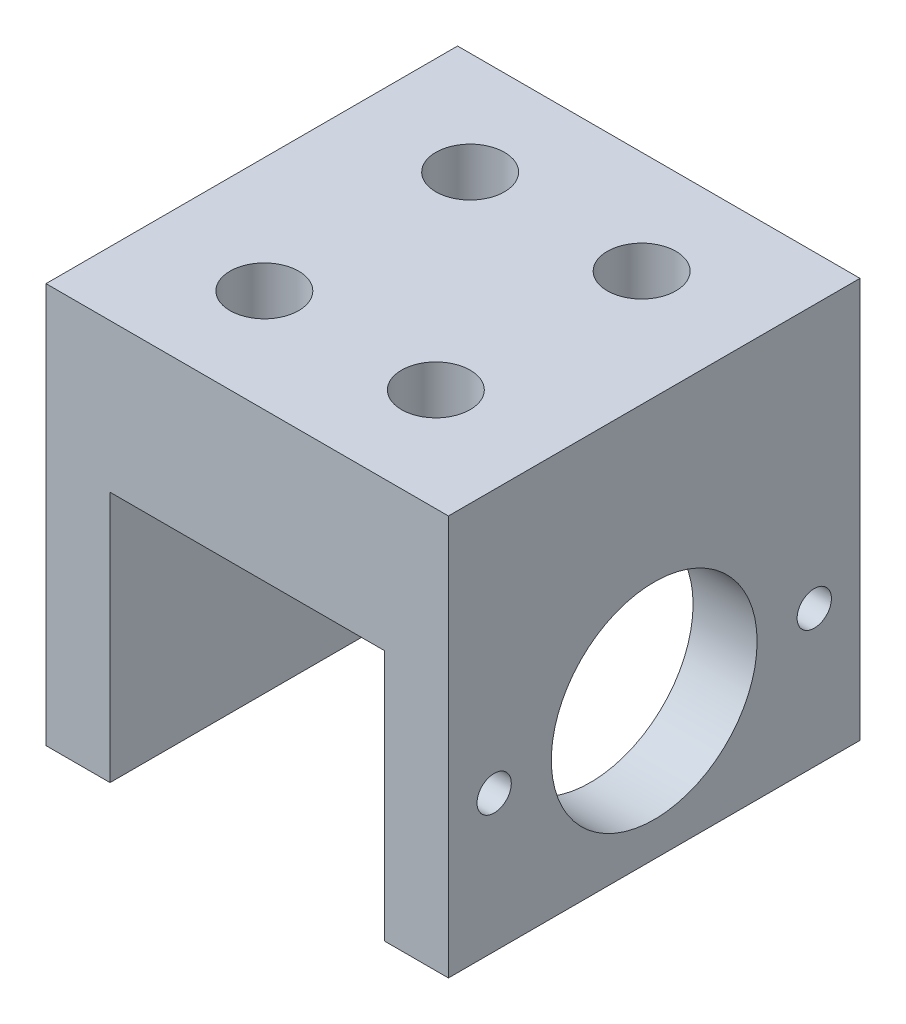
ISO-10303-21;
HEADER;
FILE_DESCRIPTION(('STEP AP214'),'2;1');
FILE_NAME('part.step','',(''),(''),'','','');
FILE_SCHEMA(('AUTOMOTIVE_DESIGN { 1 0 10303 214 1 1 1 1 }'));
ENDSEC;
DATA;
#1=APPLICATION_CONTEXT('core data for automotive mechanical design processes');
#2=APPLICATION_PROTOCOL_DEFINITION('international standard','automotive_design',2000,#1);
#3=PRODUCT_CONTEXT('',#1,'mechanical');
#4=PRODUCT('Part','Part','',(#3));
#5=PRODUCT_RELATED_PRODUCT_CATEGORY('part','',(#4));
#6=PRODUCT_DEFINITION_FORMATION('','',#4);
#7=PRODUCT_DEFINITION_CONTEXT('part definition',#1,'design');
#8=PRODUCT_DEFINITION('design','',#6,#7);
#9=PRODUCT_DEFINITION_SHAPE('','',#8);
#10=(LENGTH_UNIT() NAMED_UNIT(*) SI_UNIT(.MILLI.,.METRE.));
#11=(NAMED_UNIT(*) PLANE_ANGLE_UNIT() SI_UNIT($,.RADIAN.));
#12=(NAMED_UNIT(*) SI_UNIT($,.STERADIAN.) SOLID_ANGLE_UNIT());
#13=UNCERTAINTY_MEASURE_WITH_UNIT(LENGTH_MEASURE(1.E-05),#10,'distance_accuracy_value','');
#14=(GEOMETRIC_REPRESENTATION_CONTEXT(3) GLOBAL_UNCERTAINTY_ASSIGNED_CONTEXT((#13)) GLOBAL_UNIT_ASSIGNED_CONTEXT((#10,
#11,#12)) REPRESENTATION_CONTEXT('',''));
#15=CARTESIAN_POINT('',(0.,0.,0.));
#16=DIRECTION('',(0.,0.,1.));
#17=DIRECTION('',(1.,0.,0.));
#18=AXIS2_PLACEMENT_3D('',#15,#16,#17);
#19=CARTESIAN_POINT('',(0.,-35.,0.));
#20=DIRECTION('',(0.,1.,0.));
#21=DIRECTION('',(0.,0.,1.));
#22=AXIS2_PLACEMENT_3D('',#19,#20,#21);
#23=PLANE('',#22);
#24=DIRECTION('',(1.,0.,0.));
#25=VECTOR('',#24,1.);
#26=CARTESIAN_POINT('',(-17.6,-35.,18.));
#27=LINE('',#26,#25);
#28=CARTESIAN_POINT('',(12.,-35.,18.));
#29=VERTEX_POINT('',#28);
#30=CARTESIAN_POINT('',(17.6,-35.,18.));
#31=VERTEX_POINT('',#30);
#32=EDGE_CURVE('E41',#29,#31,#27,.T.);
#33=ORIENTED_EDGE('',*,*,#32,.F.);
#34=DIRECTION('',(0.,0.,-1.));
#35=VECTOR('',#34,1.);
#36=CARTESIAN_POINT('',(12.,-35.,18.));
#37=LINE('',#36,#35);
#38=CARTESIAN_POINT('',(12.,-35.,-18.));
#39=VERTEX_POINT('',#38);
#40=EDGE_CURVE('E90',#29,#39,#37,.T.);
#41=ORIENTED_EDGE('',*,*,#40,.T.);
#42=DIRECTION('',(-1.,0.,0.));
#43=VECTOR('',#42,1.);
#44=CARTESIAN_POINT('',(17.6,-35.,-18.));
#45=LINE('',#44,#43);
#46=CARTESIAN_POINT('',(17.6,-35.,-18.));
#47=VERTEX_POINT('',#46);
#48=EDGE_CURVE('E112',#47,#39,#45,.T.);
#49=ORIENTED_EDGE('',*,*,#48,.F.);
#50=DIRECTION('',(0.,0.,-1.));
#51=VECTOR('',#50,1.);
#52=CARTESIAN_POINT('',(17.6,-35.,18.));
#53=LINE('',#52,#51);
#54=EDGE_CURVE('E106',#31,#47,#53,.T.);
#55=ORIENTED_EDGE('',*,*,#54,.F.);
#56=EDGE_LOOP('',(#33,#41,#49,#55));
#57=FACE_BOUND('',#56,.T.);
#58=ADVANCED_FACE('F16',(#57),#23,.F.);
#59=CARTESIAN_POINT('',(17.6,-35.,18.));
#60=DIRECTION('',(1.,0.,0.));
#61=DIRECTION('',(0.,0.,-1.));
#62=AXIS2_PLACEMENT_3D('',#59,#60,#61);
#63=PLANE('',#62);
#64=CARTESIAN_POINT('',(17.6,-23.,0.));
#65=DIRECTION('',(1.,0.,0.));
#66=DIRECTION('',(0.,0.,-1.));
#67=AXIS2_PLACEMENT_3D('',#64,#65,#66);
#68=CIRCLE('',#67,9.);
#69=CARTESIAN_POINT('',(17.6,-23.,-9.));
#70=VERTEX_POINT('',#69);
#71=EDGE_CURVE('E211',#70,#70,#68,.T.);
#72=ORIENTED_EDGE('',*,*,#71,.F.);
#73=EDGE_LOOP('',(#72));
#74=FACE_BOUND('',#73,.T.);
#75=CARTESIAN_POINT('',(17.6,-23.,14.));
#76=DIRECTION('',(1.,0.,0.));
#77=DIRECTION('',(0.,0.,-1.));
#78=AXIS2_PLACEMENT_3D('',#75,#76,#77);
#79=CIRCLE('',#78,1.49999999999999);
#80=CARTESIAN_POINT('',(17.6,-23.,12.5));
#81=VERTEX_POINT('',#80);
#82=EDGE_CURVE('E136',#81,#81,#79,.T.);
#83=ORIENTED_EDGE('',*,*,#82,.F.);
#84=EDGE_LOOP('',(#83));
#85=FACE_BOUND('',#84,.T.);
#86=CARTESIAN_POINT('',(17.6,-23.,-14.));
#87=DIRECTION('',(1.,0.,0.));
#88=DIRECTION('',(0.,0.,-1.));
#89=AXIS2_PLACEMENT_3D('',#86,#87,#88);
#90=CIRCLE('',#89,1.49999999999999);
#91=CARTESIAN_POINT('',(17.6,-23.,-15.5));
#92=VERTEX_POINT('',#91);
#93=EDGE_CURVE('E164',#92,#92,#90,.T.);
#94=ORIENTED_EDGE('',*,*,#93,.F.);
#95=EDGE_LOOP('',(#94));
#96=FACE_BOUND('',#95,.T.);
#97=DIRECTION('',(0.,0.,-1.));
#98=VECTOR('',#97,1.);
#99=CARTESIAN_POINT('',(17.6,0.,18.));
#100=LINE('',#99,#98);
#101=CARTESIAN_POINT('',(17.6,0.,18.));
#102=VERTEX_POINT('',#101);
#103=CARTESIAN_POINT('',(17.6,0.,-18.));
#104=VERTEX_POINT('',#103);
#105=EDGE_CURVE('E116',#102,#104,#100,.T.);
#106=ORIENTED_EDGE('',*,*,#105,.F.);
#107=DIRECTION('',(0.,1.,0.));
#108=VECTOR('',#107,1.);
#109=CARTESIAN_POINT('',(17.6,-35.,18.));
#110=LINE('',#109,#108);
#111=EDGE_CURVE('E10',#31,#102,#110,.T.);
#112=ORIENTED_EDGE('',*,*,#111,.F.);
#113=ORIENTED_EDGE('',*,*,#54,.T.);
#114=DIRECTION('',(0.,1.,0.));
#115=VECTOR('',#114,1.);
#116=CARTESIAN_POINT('',(17.6,-35.,-18.));
#117=LINE('',#116,#115);
#118=EDGE_CURVE('E66',#47,#104,#117,.T.);
#119=ORIENTED_EDGE('',*,*,#118,.T.);
#120=EDGE_LOOP('',(#106,#112,#113,#119));
#121=FACE_BOUND('',#120,.T.);
#122=ADVANCED_FACE('F18',(#74,#85,#96,#121),#63,.T.);
#123=CARTESIAN_POINT('',(-17.6,-35.,18.));
#124=DIRECTION('',(0.,0.,1.));
#125=DIRECTION('',(1.,0.,0.));
#126=AXIS2_PLACEMENT_3D('',#123,#124,#125);
#127=PLANE('',#126);
#128=DIRECTION('',(0.,-1.,0.));
#129=VECTOR('',#128,1.);
#130=CARTESIAN_POINT('',(12.,-13.,18.));
#131=LINE('',#130,#129);
#132=CARTESIAN_POINT('',(12.,-13.,18.));
#133=VERTEX_POINT('',#132);
#134=EDGE_CURVE('E92',#133,#29,#131,.T.);
#135=ORIENTED_EDGE('',*,*,#134,.T.);
#136=ORIENTED_EDGE('',*,*,#32,.T.);
#137=ORIENTED_EDGE('',*,*,#111,.T.);
#138=DIRECTION('',(1.,0.,0.));
#139=VECTOR('',#138,1.);
#140=CARTESIAN_POINT('',(-17.6,0.,18.));
#141=LINE('',#140,#139);
#142=CARTESIAN_POINT('',(-17.6,0.,18.));
#143=VERTEX_POINT('',#142);
#144=EDGE_CURVE('E126',#143,#102,#141,.T.);
#145=ORIENTED_EDGE('',*,*,#144,.F.);
#146=DIRECTION('',(0.,1.,0.));
#147=VECTOR('',#146,1.);
#148=CARTESIAN_POINT('',(-17.6,-35.,18.));
#149=LINE('',#148,#147);
#150=CARTESIAN_POINT('',(-17.6,-35.,18.));
#151=VERTEX_POINT('',#150);
#152=EDGE_CURVE('E25',#151,#143,#149,.T.);
#153=ORIENTED_EDGE('',*,*,#152,.F.);
#154=CARTESIAN_POINT('',(-12.,-35.,18.));
#155=VERTEX_POINT('',#154);
#156=EDGE_CURVE('E107',#151,#155,#27,.T.);
#157=ORIENTED_EDGE('',*,*,#156,.T.);
#158=DIRECTION('',(0.,1.,0.));
#159=VECTOR('',#158,1.);
#160=CARTESIAN_POINT('',(-12.,-35.,18.));
#161=LINE('',#160,#159);
#162=CARTESIAN_POINT('',(-12.,-13.,18.));
#163=VERTEX_POINT('',#162);
#164=EDGE_CURVE('E33',#155,#163,#161,.T.);
#165=ORIENTED_EDGE('',*,*,#164,.T.);
#166=DIRECTION('',(1.,0.,0.));
#167=VECTOR('',#166,1.);
#168=CARTESIAN_POINT('',(-12.,-13.,18.));
#169=LINE('',#168,#167);
#170=EDGE_CURVE('E98',#163,#133,#169,.T.);
#171=ORIENTED_EDGE('',*,*,#170,.T.);
#172=EDGE_LOOP('',(#135,#136,#137,#145,#153,#157,#165,#171));
#173=FACE_BOUND('',#172,.T.);
#174=ADVANCED_FACE('F100',(#173),#127,.T.);
#175=CARTESIAN_POINT('',(-17.6,-35.,-18.));
#176=DIRECTION('',(-1.,0.,0.));
#177=DIRECTION('',(0.,0.,1.));
#178=AXIS2_PLACEMENT_3D('',#175,#176,#177);
#179=PLANE('',#178);
#180=DIRECTION('',(0.,0.,1.));
#181=VECTOR('',#180,1.);
#182=CARTESIAN_POINT('',(-17.6,0.,-18.));
#183=LINE('',#182,#181);
#184=CARTESIAN_POINT('',(-17.6,0.,-18.));
#185=VERTEX_POINT('',#184);
#186=EDGE_CURVE('E123',#185,#143,#183,.T.);
#187=ORIENTED_EDGE('',*,*,#186,.F.);
#188=DIRECTION('',(0.,1.,0.));
#189=VECTOR('',#188,1.);
#190=CARTESIAN_POINT('',(-17.6,-35.,-18.));
#191=LINE('',#190,#189);
#192=CARTESIAN_POINT('',(-17.6,-35.,-18.));
#193=VERTEX_POINT('',#192);
#194=EDGE_CURVE('E130',#193,#185,#191,.T.);
#195=ORIENTED_EDGE('',*,*,#194,.F.);
#196=DIRECTION('',(0.,0.,1.));
#197=VECTOR('',#196,1.);
#198=CARTESIAN_POINT('',(-17.6,-35.,-18.));
#199=LINE('',#198,#197);
#200=EDGE_CURVE('E108',#193,#151,#199,.T.);
#201=ORIENTED_EDGE('',*,*,#200,.T.);
#202=ORIENTED_EDGE('',*,*,#152,.T.);
#203=EDGE_LOOP('',(#187,#195,#201,#202));
#204=FACE_BOUND('',#203,.T.);
#205=ADVANCED_FACE('F192',(#204),#179,.T.);
#206=CARTESIAN_POINT('',(17.6,-35.,-18.));
#207=DIRECTION('',(0.,0.,-1.));
#208=DIRECTION('',(-1.,0.,0.));
#209=AXIS2_PLACEMENT_3D('',#206,#207,#208);
#210=PLANE('',#209);
#211=DIRECTION('',(0.,-1.,0.));
#212=VECTOR('',#211,1.);
#213=CARTESIAN_POINT('',(12.,-13.,-18.));
#214=LINE('',#213,#212);
#215=CARTESIAN_POINT('',(12.,-13.,-18.));
#216=VERTEX_POINT('',#215);
#217=EDGE_CURVE('E95',#216,#39,#214,.T.);
#218=ORIENTED_EDGE('',*,*,#217,.F.);
#219=DIRECTION('',(1.,0.,0.));
#220=VECTOR('',#219,1.);
#221=CARTESIAN_POINT('',(-12.,-13.,-18.));
#222=LINE('',#221,#220);
#223=CARTESIAN_POINT('',(-12.,-13.,-18.));
#224=VERTEX_POINT('',#223);
#225=EDGE_CURVE('E102',#224,#216,#222,.T.);
#226=ORIENTED_EDGE('',*,*,#225,.F.);
#227=DIRECTION('',(0.,1.,0.));
#228=VECTOR('',#227,1.);
#229=CARTESIAN_POINT('',(-12.,-35.,-18.));
#230=LINE('',#229,#228);
#231=CARTESIAN_POINT('',(-12.,-35.,-18.));
#232=VERTEX_POINT('',#231);
#233=EDGE_CURVE('E173',#232,#224,#230,.T.);
#234=ORIENTED_EDGE('',*,*,#233,.F.);
#235=EDGE_CURVE('E182',#232,#193,#45,.T.);
#236=ORIENTED_EDGE('',*,*,#235,.T.);
#237=ORIENTED_EDGE('',*,*,#194,.T.);
#238=DIRECTION('',(-1.,0.,0.));
#239=VECTOR('',#238,1.);
#240=CARTESIAN_POINT('',(17.6,0.,-18.));
#241=LINE('',#240,#239);
#242=EDGE_CURVE('E119',#104,#185,#241,.T.);
#243=ORIENTED_EDGE('',*,*,#242,.F.);
#244=ORIENTED_EDGE('',*,*,#118,.F.);
#245=ORIENTED_EDGE('',*,*,#48,.T.);
#246=EDGE_LOOP('',(#218,#226,#234,#236,#237,#243,#244,#245));
#247=FACE_BOUND('',#246,.T.);
#248=ADVANCED_FACE('F186',(#247),#210,.T.);
#249=ORIENTED_EDGE('',*,*,#235,.F.);
#250=DIRECTION('',(0.,0.,-1.));
#251=VECTOR('',#250,1.);
#252=CARTESIAN_POINT('',(-12.,-35.,18.));
#253=LINE('',#252,#251);
#254=EDGE_CURVE('E97',#155,#232,#253,.T.);
#255=ORIENTED_EDGE('',*,*,#254,.F.);
#256=ORIENTED_EDGE('',*,*,#156,.F.);
#257=ORIENTED_EDGE('',*,*,#200,.F.);
#258=EDGE_LOOP('',(#249,#255,#256,#257));
#259=FACE_BOUND('',#258,.T.);
#260=ADVANCED_FACE('F194',(#259),#23,.F.);
#261=CARTESIAN_POINT('',(0.,0.,0.));
#262=DIRECTION('',(0.,1.,0.));
#263=DIRECTION('',(0.,0.,1.));
#264=AXIS2_PLACEMENT_3D('',#261,#262,#263);
#265=PLANE('',#264);
#266=CARTESIAN_POINT('',(7.5,0.,9.));
#267=DIRECTION('',(0.,1.,0.));
#268=DIRECTION('',(0.,0.,1.));
#269=AXIS2_PLACEMENT_3D('',#266,#267,#268);
#270=CIRCLE('',#269,3.);
#271=CARTESIAN_POINT('',(7.5,0.,12.));
#272=VERTEX_POINT('',#271);
#273=EDGE_CURVE('E153',#272,#272,#270,.T.);
#274=ORIENTED_EDGE('',*,*,#273,.F.);
#275=EDGE_LOOP('',(#274));
#276=FACE_BOUND('',#275,.T.);
#277=CARTESIAN_POINT('',(-7.5,0.,9.));
#278=DIRECTION('',(0.,1.,0.));
#279=DIRECTION('',(0.,0.,1.));
#280=AXIS2_PLACEMENT_3D('',#277,#278,#279);
#281=CIRCLE('',#280,3.);
#282=CARTESIAN_POINT('',(-7.5,0.,12.));
#283=VERTEX_POINT('',#282);
#284=EDGE_CURVE('E143',#283,#283,#281,.T.);
#285=ORIENTED_EDGE('',*,*,#284,.F.);
#286=EDGE_LOOP('',(#285));
#287=FACE_BOUND('',#286,.T.);
#288=CARTESIAN_POINT('',(-7.5,0.,-9.));
#289=DIRECTION('',(0.,1.,0.));
#290=DIRECTION('',(0.,0.,1.));
#291=AXIS2_PLACEMENT_3D('',#288,#289,#290);
#292=CIRCLE('',#291,3.);
#293=CARTESIAN_POINT('',(-7.5,0.,-6.));
#294=VERTEX_POINT('',#293);
#295=EDGE_CURVE('E140',#294,#294,#292,.T.);
#296=ORIENTED_EDGE('',*,*,#295,.F.);
#297=EDGE_LOOP('',(#296));
#298=FACE_BOUND('',#297,.T.);
#299=CARTESIAN_POINT('',(7.5,0.,-9.));
#300=DIRECTION('',(0.,1.,0.));
#301=DIRECTION('',(0.,0.,1.));
#302=AXIS2_PLACEMENT_3D('',#299,#300,#301);
#303=CIRCLE('',#302,3.);
#304=CARTESIAN_POINT('',(7.5,0.,-6.));
#305=VERTEX_POINT('',#304);
#306=EDGE_CURVE('E137',#305,#305,#303,.T.);
#307=ORIENTED_EDGE('',*,*,#306,.F.);
#308=EDGE_LOOP('',(#307));
#309=FACE_BOUND('',#308,.T.);
#310=ORIENTED_EDGE('',*,*,#105,.T.);
#311=ORIENTED_EDGE('',*,*,#242,.T.);
#312=ORIENTED_EDGE('',*,*,#186,.T.);
#313=ORIENTED_EDGE('',*,*,#144,.T.);
#314=EDGE_LOOP('',(#310,#311,#312,#313));
#315=FACE_BOUND('',#314,.T.);
#316=ADVANCED_FACE('F196',(#276,#287,#298,#309,#315),#265,.T.);
#317=CARTESIAN_POINT('',(12.,-13.,18.));
#318=DIRECTION('',(1.,0.,0.));
#319=DIRECTION('',(0.,0.,-1.));
#320=AXIS2_PLACEMENT_3D('',#317,#318,#319);
#321=PLANE('',#320);
#322=CARTESIAN_POINT('',(12.,-23.,0.));
#323=DIRECTION('',(1.,0.,0.));
#324=DIRECTION('',(0.,0.,-1.));
#325=AXIS2_PLACEMENT_3D('',#322,#323,#324);
#326=CIRCLE('',#325,9.);
#327=CARTESIAN_POINT('',(12.,-23.,-9.));
#328=VERTEX_POINT('',#327);
#329=EDGE_CURVE('E333',#328,#328,#326,.T.);
#330=ORIENTED_EDGE('',*,*,#329,.T.);
#331=EDGE_LOOP('',(#330));
#332=FACE_BOUND('',#331,.T.);
#333=CARTESIAN_POINT('',(12.,-23.,14.));
#334=DIRECTION('',(1.,0.,0.));
#335=DIRECTION('',(0.,0.,-1.));
#336=AXIS2_PLACEMENT_3D('',#333,#334,#335);
#337=CIRCLE('',#336,1.5);
#338=CARTESIAN_POINT('',(12.,-23.,12.5));
#339=VERTEX_POINT('',#338);
#340=EDGE_CURVE('E161',#339,#339,#337,.T.);
#341=ORIENTED_EDGE('',*,*,#340,.T.);
#342=EDGE_LOOP('',(#341));
#343=FACE_BOUND('',#342,.T.);
#344=CARTESIAN_POINT('',(12.,-23.,-14.));
#345=DIRECTION('',(1.,0.,0.));
#346=DIRECTION('',(0.,0.,-1.));
#347=AXIS2_PLACEMENT_3D('',#344,#345,#346);
#348=CIRCLE('',#347,1.5);
#349=CARTESIAN_POINT('',(12.,-23.,-15.5));
#350=VERTEX_POINT('',#349);
#351=EDGE_CURVE('E167',#350,#350,#348,.T.);
#352=ORIENTED_EDGE('',*,*,#351,.T.);
#353=EDGE_LOOP('',(#352));
#354=FACE_BOUND('',#353,.T.);
#355=ORIENTED_EDGE('',*,*,#217,.T.);
#356=ORIENTED_EDGE('',*,*,#40,.F.);
#357=ORIENTED_EDGE('',*,*,#134,.F.);
#358=DIRECTION('',(0.,0.,-1.));
#359=VECTOR('',#358,1.);
#360=CARTESIAN_POINT('',(12.,-13.,18.));
#361=LINE('',#360,#359);
#362=EDGE_CURVE('E120',#133,#216,#361,.T.);
#363=ORIENTED_EDGE('',*,*,#362,.T.);
#364=EDGE_LOOP('',(#355,#356,#357,#363));
#365=FACE_BOUND('',#364,.T.);
#366=ADVANCED_FACE('F91',(#332,#343,#354,#365),#321,.F.);
#367=CARTESIAN_POINT('',(-12.,-13.,18.));
#368=DIRECTION('',(0.,1.,0.));
#369=DIRECTION('',(0.,0.,1.));
#370=AXIS2_PLACEMENT_3D('',#367,#368,#369);
#371=PLANE('',#370);
#372=CARTESIAN_POINT('',(7.5,-13.,9.));
#373=DIRECTION('',(0.,1.,0.));
#374=DIRECTION('',(0.,0.,1.));
#375=AXIS2_PLACEMENT_3D('',#372,#373,#374);
#376=CIRCLE('',#375,3.);
#377=CARTESIAN_POINT('',(7.5,-13.,12.));
#378=VERTEX_POINT('',#377);
#379=EDGE_CURVE('E20',#378,#378,#376,.T.);
#380=ORIENTED_EDGE('',*,*,#379,.T.);
#381=EDGE_LOOP('',(#380));
#382=FACE_BOUND('',#381,.T.);
#383=CARTESIAN_POINT('',(-7.5,-13.,9.));
#384=DIRECTION('',(0.,1.,0.));
#385=DIRECTION('',(0.,0.,1.));
#386=AXIS2_PLACEMENT_3D('',#383,#384,#385);
#387=CIRCLE('',#386,3.);
#388=CARTESIAN_POINT('',(-7.5,-13.,12.));
#389=VERTEX_POINT('',#388);
#390=EDGE_CURVE('E141',#389,#389,#387,.T.);
#391=ORIENTED_EDGE('',*,*,#390,.T.);
#392=EDGE_LOOP('',(#391));
#393=FACE_BOUND('',#392,.T.);
#394=CARTESIAN_POINT('',(-7.5,-13.,-9.));
#395=DIRECTION('',(0.,1.,0.));
#396=DIRECTION('',(0.,0.,1.));
#397=AXIS2_PLACEMENT_3D('',#394,#395,#396);
#398=CIRCLE('',#397,3.);
#399=CARTESIAN_POINT('',(-7.5,-13.,-6.));
#400=VERTEX_POINT('',#399);
#401=EDGE_CURVE('E138',#400,#400,#398,.T.);
#402=ORIENTED_EDGE('',*,*,#401,.T.);
#403=EDGE_LOOP('',(#402));
#404=FACE_BOUND('',#403,.T.);
#405=CARTESIAN_POINT('',(7.5,-13.,-9.));
#406=DIRECTION('',(0.,1.,0.));
#407=DIRECTION('',(0.,0.,1.));
#408=AXIS2_PLACEMENT_3D('',#405,#406,#407);
#409=CIRCLE('',#408,3.);
#410=CARTESIAN_POINT('',(7.5,-13.,-6.));
#411=VERTEX_POINT('',#410);
#412=EDGE_CURVE('E133',#411,#411,#409,.T.);
#413=ORIENTED_EDGE('',*,*,#412,.T.);
#414=EDGE_LOOP('',(#413));
#415=FACE_BOUND('',#414,.T.);
#416=ORIENTED_EDGE('',*,*,#225,.T.);
#417=ORIENTED_EDGE('',*,*,#362,.F.);
#418=ORIENTED_EDGE('',*,*,#170,.F.);
#419=DIRECTION('',(0.,0.,-1.));
#420=VECTOR('',#419,1.);
#421=CARTESIAN_POINT('',(-12.,-13.,18.));
#422=LINE('',#421,#420);
#423=EDGE_CURVE('E179',#163,#224,#422,.T.);
#424=ORIENTED_EDGE('',*,*,#423,.T.);
#425=EDGE_LOOP('',(#416,#417,#418,#424));
#426=FACE_BOUND('',#425,.T.);
#427=ADVANCED_FACE('F230',(#382,#393,#404,#415,#426),#371,.F.);
#428=CARTESIAN_POINT('',(-12.,-35.,18.));
#429=DIRECTION('',(-1.,0.,0.));
#430=DIRECTION('',(0.,0.,1.));
#431=AXIS2_PLACEMENT_3D('',#428,#429,#430);
#432=PLANE('',#431);
#433=ORIENTED_EDGE('',*,*,#233,.T.);
#434=ORIENTED_EDGE('',*,*,#423,.F.);
#435=ORIENTED_EDGE('',*,*,#164,.F.);
#436=ORIENTED_EDGE('',*,*,#254,.T.);
#437=EDGE_LOOP('',(#433,#434,#435,#436));
#438=FACE_BOUND('',#437,.T.);
#439=ADVANCED_FACE('F219',(#438),#432,.F.);
#440=CARTESIAN_POINT('',(17.6,-23.,-14.));
#441=DIRECTION('',(1.,0.,0.));
#442=DIRECTION('',(0.,0.,-1.));
#443=AXIS2_PLACEMENT_3D('',#440,#441,#442);
#444=CYLINDRICAL_SURFACE('',#443,1.5);
#445=ORIENTED_EDGE('',*,*,#351,.F.);
#446=EDGE_LOOP('',(#445));
#447=FACE_BOUND('',#446,.T.);
#448=ORIENTED_EDGE('',*,*,#93,.T.);
#449=EDGE_LOOP('',(#448));
#450=FACE_BOUND('',#449,.T.);
#451=ADVANCED_FACE('F216',(#447,#450),#444,.F.);
#452=CARTESIAN_POINT('',(17.6,-23.,14.));
#453=DIRECTION('',(1.,0.,0.));
#454=DIRECTION('',(0.,0.,-1.));
#455=AXIS2_PLACEMENT_3D('',#452,#453,#454);
#456=CYLINDRICAL_SURFACE('',#455,1.5);
#457=ORIENTED_EDGE('',*,*,#340,.F.);
#458=EDGE_LOOP('',(#457));
#459=FACE_BOUND('',#458,.T.);
#460=ORIENTED_EDGE('',*,*,#82,.T.);
#461=EDGE_LOOP('',(#460));
#462=FACE_BOUND('',#461,.T.);
#463=ADVANCED_FACE('F218',(#459,#462),#456,.F.);
#464=CARTESIAN_POINT('',(7.5,0.,-9.));
#465=DIRECTION('',(0.,1.,0.));
#466=DIRECTION('',(0.,0.,1.));
#467=AXIS2_PLACEMENT_3D('',#464,#465,#466);
#468=CYLINDRICAL_SURFACE('',#467,3.);
#469=ORIENTED_EDGE('',*,*,#306,.T.);
#470=EDGE_LOOP('',(#469));
#471=FACE_BOUND('',#470,.T.);
#472=ORIENTED_EDGE('',*,*,#412,.F.);
#473=EDGE_LOOP('',(#472));
#474=FACE_BOUND('',#473,.T.);
#475=ADVANCED_FACE('F227',(#471,#474),#468,.F.);
#476=CARTESIAN_POINT('',(-7.5,0.,-9.));
#477=DIRECTION('',(0.,1.,0.));
#478=DIRECTION('',(0.,0.,1.));
#479=AXIS2_PLACEMENT_3D('',#476,#477,#478);
#480=CYLINDRICAL_SURFACE('',#479,3.);
#481=ORIENTED_EDGE('',*,*,#295,.T.);
#482=EDGE_LOOP('',(#481));
#483=FACE_BOUND('',#482,.T.);
#484=ORIENTED_EDGE('',*,*,#401,.F.);
#485=EDGE_LOOP('',(#484));
#486=FACE_BOUND('',#485,.T.);
#487=ADVANCED_FACE('F298',(#483,#486),#480,.F.);
#488=CARTESIAN_POINT('',(-7.5,0.,9.));
#489=DIRECTION('',(0.,1.,0.));
#490=DIRECTION('',(0.,0.,1.));
#491=AXIS2_PLACEMENT_3D('',#488,#489,#490);
#492=CYLINDRICAL_SURFACE('',#491,3.);
#493=ORIENTED_EDGE('',*,*,#284,.T.);
#494=EDGE_LOOP('',(#493));
#495=FACE_BOUND('',#494,.T.);
#496=ORIENTED_EDGE('',*,*,#390,.F.);
#497=EDGE_LOOP('',(#496));
#498=FACE_BOUND('',#497,.T.);
#499=ADVANCED_FACE('F305',(#495,#498),#492,.F.);
#500=CARTESIAN_POINT('',(7.5,0.,9.));
#501=DIRECTION('',(0.,1.,0.));
#502=DIRECTION('',(0.,0.,1.));
#503=AXIS2_PLACEMENT_3D('',#500,#501,#502);
#504=CYLINDRICAL_SURFACE('',#503,3.);
#505=ORIENTED_EDGE('',*,*,#273,.T.);
#506=EDGE_LOOP('',(#505));
#507=FACE_BOUND('',#506,.T.);
#508=ORIENTED_EDGE('',*,*,#379,.F.);
#509=EDGE_LOOP('',(#508));
#510=FACE_BOUND('',#509,.T.);
#511=ADVANCED_FACE('F313',(#507,#510),#504,.F.);
#512=CARTESIAN_POINT('',(17.6,-23.,0.));
#513=DIRECTION('',(1.,0.,0.));
#514=DIRECTION('',(0.,0.,-1.));
#515=AXIS2_PLACEMENT_3D('',#512,#513,#514);
#516=CYLINDRICAL_SURFACE('',#515,9.);
#517=ORIENTED_EDGE('',*,*,#329,.F.);
#518=EDGE_LOOP('',(#517));
#519=FACE_BOUND('',#518,.T.);
#520=ORIENTED_EDGE('',*,*,#71,.T.);
#521=EDGE_LOOP('',(#520));
#522=FACE_BOUND('',#521,.T.);
#523=ADVANCED_FACE('F320',(#519,#522),#516,.F.);
#524=CLOSED_SHELL('',(#58,#122,#174,#205,#248,#260,#316,#366,#427,#439,#451,#463,#475,#487,#499,
#511,#523));
#525=MANIFOLD_SOLID_BREP('B1',#524);
#526=ADVANCED_BREP_SHAPE_REPRESENTATION('',(#18,#525),#14);
#527=SHAPE_DEFINITION_REPRESENTATION(#9,#526);
ENDSEC;
END-ISO-10303-21;
